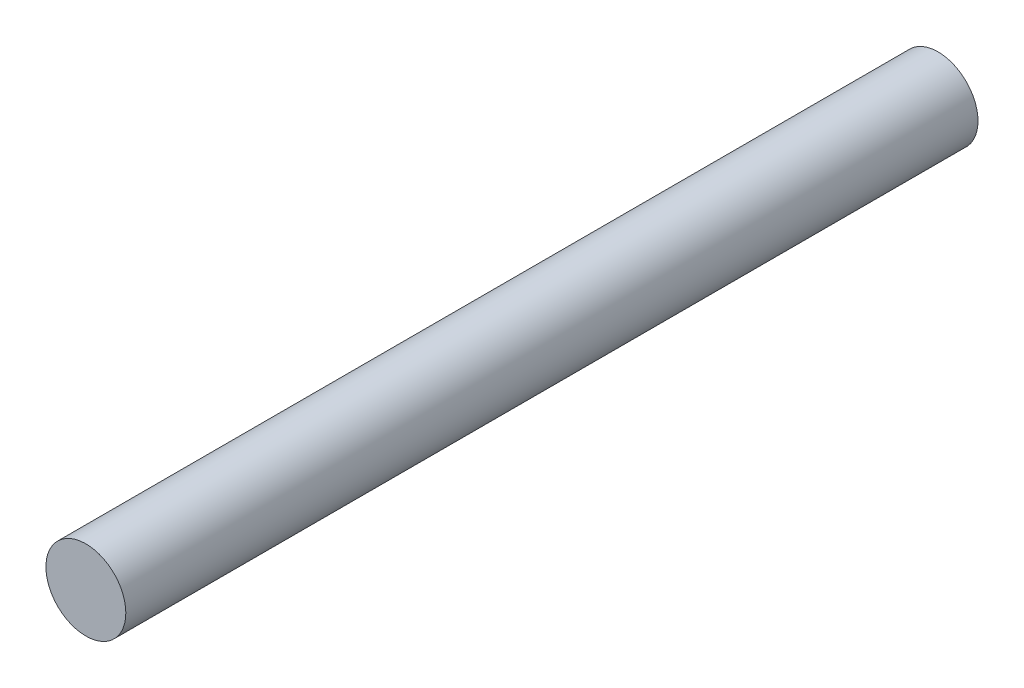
from build123d import *

# Parameters (mm, degrees)
SKETCH1_R      = 2.38125
EXTRUDE1_DEPTH = 50.8


with BuildPart() as part:
    # Sketch1 → Extrude1 (new body)
    with BuildSketch(Plane.XY):
        Circle(SKETCH1_R)
    extrude(amount=EXTRUDE1_DEPTH)


solid = part.part
